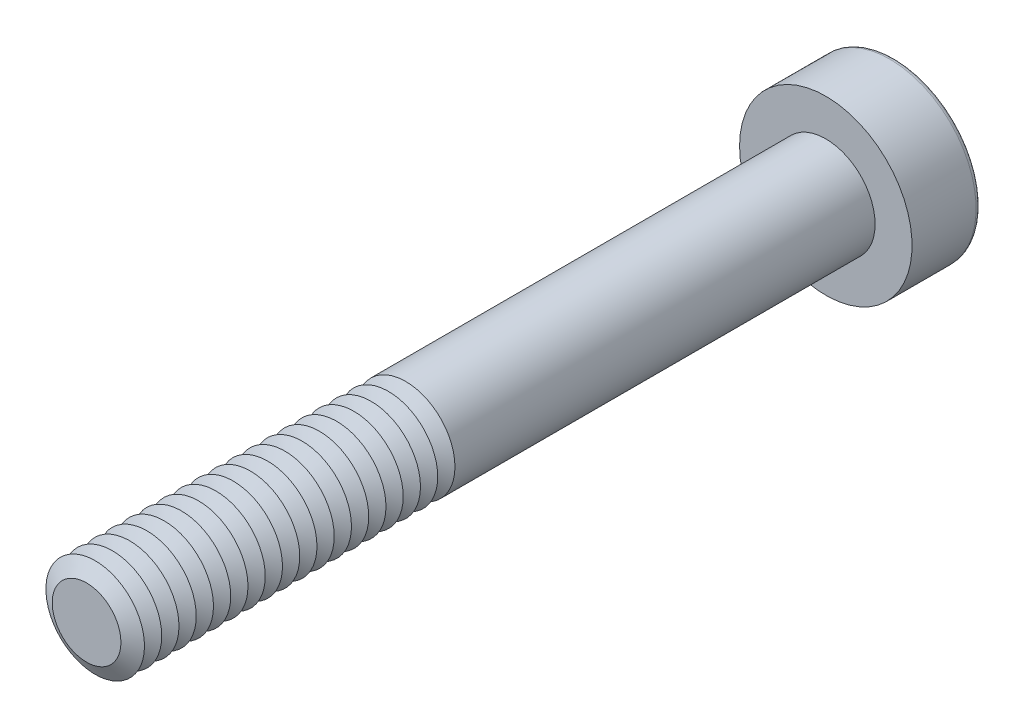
ISO-10303-21;
HEADER;
FILE_DESCRIPTION(('STEP AP214'),'2;1');
FILE_NAME('part.step','',(''),(''),'','','');
FILE_SCHEMA(('AUTOMOTIVE_DESIGN { 1 0 10303 214 1 1 1 1 }'));
ENDSEC;
DATA;
#1=APPLICATION_CONTEXT('core data for automotive mechanical design processes');
#2=APPLICATION_PROTOCOL_DEFINITION('international standard','automotive_design',2000,#1);
#3=PRODUCT_CONTEXT('',#1,'mechanical');
#4=PRODUCT('Part','Part','',(#3));
#5=PRODUCT_RELATED_PRODUCT_CATEGORY('part','',(#4));
#6=PRODUCT_DEFINITION_FORMATION('','',#4);
#7=PRODUCT_DEFINITION_CONTEXT('part definition',#1,'design');
#8=PRODUCT_DEFINITION('design','',#6,#7);
#9=PRODUCT_DEFINITION_SHAPE('','',#8);
#10=(LENGTH_UNIT() NAMED_UNIT(*) SI_UNIT(.MILLI.,.METRE.));
#11=(NAMED_UNIT(*) PLANE_ANGLE_UNIT() SI_UNIT($,.RADIAN.));
#12=(NAMED_UNIT(*) SI_UNIT($,.STERADIAN.) SOLID_ANGLE_UNIT());
#13=UNCERTAINTY_MEASURE_WITH_UNIT(LENGTH_MEASURE(1.E-05),#10,'distance_accuracy_value','');
#14=(GEOMETRIC_REPRESENTATION_CONTEXT(3) GLOBAL_UNCERTAINTY_ASSIGNED_CONTEXT((#13)) GLOBAL_UNIT_ASSIGNED_CONTEXT((#10,
#11,#12)) REPRESENTATION_CONTEXT('',''));
#15=CARTESIAN_POINT('',(0.,0.,0.));
#16=DIRECTION('',(0.,0.,1.));
#17=DIRECTION('',(1.,0.,0.));
#18=AXIS2_PLACEMENT_3D('',#15,#16,#17);
#19=CARTESIAN_POINT('',(0.,0.,27.55));
#20=DIRECTION('',(0.,0.,1.));
#21=DIRECTION('',(1.,0.,0.));
#22=AXIS2_PLACEMENT_3D('',#19,#20,#21);
#23=CONICAL_SURFACE('',#22,2.,1.0471975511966);
#24=CARTESIAN_POINT('',(0.,0.,27.2));
#25=DIRECTION('',(0.,0.,1.));
#26=DIRECTION('',(1.,0.,0.));
#27=AXIS2_PLACEMENT_3D('',#24,#25,#26);
#28=CIRCLE('',#27,1.39378221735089);
#29=CARTESIAN_POINT('',(1.39378221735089,0.,27.2));
#30=VERTEX_POINT('',#29);
#31=EDGE_CURVE('E312',#30,#30,#28,.T.);
#32=ORIENTED_EDGE('',*,*,#31,.T.);
#33=EDGE_LOOP('',(#32));
#34=FACE_BOUND('',#33,.T.);
#35=CARTESIAN_POINT('',(0.,0.,27.55));
#36=DIRECTION('',(0.,0.,1.));
#37=DIRECTION('',(1.,0.,0.));
#38=AXIS2_PLACEMENT_3D('',#35,#36,#37);
#39=CIRCLE('',#38,2.);
#40=CARTESIAN_POINT('',(2.,0.,27.55));
#41=VERTEX_POINT('',#40);
#42=EDGE_CURVE('E315',#41,#41,#39,.T.);
#43=ORIENTED_EDGE('',*,*,#42,.F.);
#44=EDGE_LOOP('',(#43));
#45=FACE_BOUND('',#44,.T.);
#46=ADVANCED_FACE('F39',(#34,#45),#23,.T.);
#47=CARTESIAN_POINT('',(0.,0.,27.2));
#48=DIRECTION('',(0.,0.,-1.));
#49=DIRECTION('',(-1.,0.,0.));
#50=AXIS2_PLACEMENT_3D('',#47,#48,#49);
#51=CONICAL_SURFACE('',#50,1.39378221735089,1.0471975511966);
#52=CARTESIAN_POINT('',(0.,0.,26.85));
#53=DIRECTION('',(0.,0.,1.));
#54=DIRECTION('',(1.,0.,0.));
#55=AXIS2_PLACEMENT_3D('',#52,#53,#54);
#56=CIRCLE('',#55,2.);
#57=CARTESIAN_POINT('',(2.,0.,26.85));
#58=VERTEX_POINT('',#57);
#59=EDGE_CURVE('E323',#58,#58,#56,.T.);
#60=ORIENTED_EDGE('',*,*,#59,.T.);
#61=EDGE_LOOP('',(#60));
#62=FACE_BOUND('',#61,.T.);
#63=ORIENTED_EDGE('',*,*,#31,.F.);
#64=EDGE_LOOP('',(#63));
#65=FACE_BOUND('',#64,.T.);
#66=ADVANCED_FACE('F245',(#62,#65),#51,.T.);
#67=CARTESIAN_POINT('',(0.,0.,30.));
#68=DIRECTION('',(0.,0.,1.));
#69=DIRECTION('',(1.,0.,0.));
#70=AXIS2_PLACEMENT_3D('',#67,#68,#69);
#71=PLANE('',#70);
#72=CARTESIAN_POINT('',(0.,0.,30.));
#73=DIRECTION('',(0.,0.,1.));
#74=DIRECTION('',(1.,0.,0.));
#75=AXIS2_PLACEMENT_3D('',#72,#73,#74);
#76=CIRCLE('',#75,1.39378221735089);
#77=CARTESIAN_POINT('',(1.39378221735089,0.,30.));
#78=VERTEX_POINT('',#77);
#79=EDGE_CURVE('E174',#78,#78,#76,.T.);
#80=ORIENTED_EDGE('',*,*,#79,.T.);
#81=EDGE_LOOP('',(#80));
#82=FACE_BOUND('',#81,.T.);
#83=ADVANCED_FACE('F251',(#82),#71,.T.);
#84=CARTESIAN_POINT('',(0.,0.,30.));
#85=DIRECTION('',(0.,0.,-1.));
#86=DIRECTION('',(-1.,0.,0.));
#87=AXIS2_PLACEMENT_3D('',#84,#85,#86);
#88=CONICAL_SURFACE('',#87,1.39378221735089,1.0471975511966);
#89=CARTESIAN_POINT('',(0.,0.,29.65));
#90=DIRECTION('',(0.,0.,1.));
#91=DIRECTION('',(1.,0.,0.));
#92=AXIS2_PLACEMENT_3D('',#89,#90,#91);
#93=CIRCLE('',#92,2.);
#94=CARTESIAN_POINT('',(2.,0.,29.65));
#95=VERTEX_POINT('',#94);
#96=EDGE_CURVE('E291',#95,#95,#93,.T.);
#97=ORIENTED_EDGE('',*,*,#96,.T.);
#98=EDGE_LOOP('',(#97));
#99=FACE_BOUND('',#98,.T.);
#100=ORIENTED_EDGE('',*,*,#79,.F.);
#101=EDGE_LOOP('',(#100));
#102=FACE_BOUND('',#101,.T.);
#103=ADVANCED_FACE('F199',(#99,#102),#88,.T.);
#104=CARTESIAN_POINT('',(0.,0.,29.65));
#105=DIRECTION('',(0.,0.,1.));
#106=DIRECTION('',(1.,0.,0.));
#107=AXIS2_PLACEMENT_3D('',#104,#105,#106);
#108=CONICAL_SURFACE('',#107,2.,1.0471975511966);
#109=CARTESIAN_POINT('',(0.,0.,29.3));
#110=DIRECTION('',(0.,0.,1.));
#111=DIRECTION('',(1.,0.,0.));
#112=AXIS2_PLACEMENT_3D('',#109,#110,#111);
#113=CIRCLE('',#112,1.39378221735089);
#114=CARTESIAN_POINT('',(1.39378221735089,0.,29.3));
#115=VERTEX_POINT('',#114);
#116=EDGE_CURVE('E288',#115,#115,#113,.T.);
#117=ORIENTED_EDGE('',*,*,#116,.T.);
#118=EDGE_LOOP('',(#117));
#119=FACE_BOUND('',#118,.T.);
#120=ORIENTED_EDGE('',*,*,#96,.F.);
#121=EDGE_LOOP('',(#120));
#122=FACE_BOUND('',#121,.T.);
#123=ADVANCED_FACE('F277',(#119,#122),#108,.T.);
#124=CARTESIAN_POINT('',(0.,0.,29.3));
#125=DIRECTION('',(0.,0.,-1.));
#126=DIRECTION('',(-1.,0.,0.));
#127=AXIS2_PLACEMENT_3D('',#124,#125,#126);
#128=CONICAL_SURFACE('',#127,1.39378221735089,1.0471975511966);
#129=CARTESIAN_POINT('',(0.,0.,28.95));
#130=DIRECTION('',(0.,0.,1.));
#131=DIRECTION('',(1.,0.,0.));
#132=AXIS2_PLACEMENT_3D('',#129,#130,#131);
#133=CIRCLE('',#132,2.);
#134=CARTESIAN_POINT('',(2.,0.,28.95));
#135=VERTEX_POINT('',#134);
#136=EDGE_CURVE('E298',#135,#135,#133,.T.);
#137=ORIENTED_EDGE('',*,*,#136,.T.);
#138=EDGE_LOOP('',(#137));
#139=FACE_BOUND('',#138,.T.);
#140=ORIENTED_EDGE('',*,*,#116,.F.);
#141=EDGE_LOOP('',(#140));
#142=FACE_BOUND('',#141,.T.);
#143=ADVANCED_FACE('F274',(#139,#142),#128,.T.);
#144=CARTESIAN_POINT('',(0.,0.,28.95));
#145=DIRECTION('',(0.,0.,1.));
#146=DIRECTION('',(1.,0.,0.));
#147=AXIS2_PLACEMENT_3D('',#144,#145,#146);
#148=CONICAL_SURFACE('',#147,2.,1.0471975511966);
#149=CARTESIAN_POINT('',(0.,0.,28.6));
#150=DIRECTION('',(0.,0.,1.));
#151=DIRECTION('',(1.,0.,0.));
#152=AXIS2_PLACEMENT_3D('',#149,#150,#151);
#153=CIRCLE('',#152,1.39378221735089);
#154=CARTESIAN_POINT('',(1.39378221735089,0.,28.6));
#155=VERTEX_POINT('',#154);
#156=EDGE_CURVE('E292',#155,#155,#153,.T.);
#157=ORIENTED_EDGE('',*,*,#156,.T.);
#158=EDGE_LOOP('',(#157));
#159=FACE_BOUND('',#158,.T.);
#160=ORIENTED_EDGE('',*,*,#136,.F.);
#161=EDGE_LOOP('',(#160));
#162=FACE_BOUND('',#161,.T.);
#163=ADVANCED_FACE('F270',(#159,#162),#148,.T.);
#164=CARTESIAN_POINT('',(0.,0.,28.6));
#165=DIRECTION('',(0.,0.,-1.));
#166=DIRECTION('',(-1.,0.,0.));
#167=AXIS2_PLACEMENT_3D('',#164,#165,#166);
#168=CONICAL_SURFACE('',#167,1.39378221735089,1.0471975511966);
#169=CARTESIAN_POINT('',(0.,0.,28.25));
#170=DIRECTION('',(0.,0.,1.));
#171=DIRECTION('',(1.,0.,0.));
#172=AXIS2_PLACEMENT_3D('',#169,#170,#171);
#173=CIRCLE('',#172,2.);
#174=CARTESIAN_POINT('',(2.,0.,28.25));
#175=VERTEX_POINT('',#174);
#176=EDGE_CURVE('E308',#175,#175,#173,.T.);
#177=ORIENTED_EDGE('',*,*,#176,.T.);
#178=EDGE_LOOP('',(#177));
#179=FACE_BOUND('',#178,.T.);
#180=ORIENTED_EDGE('',*,*,#156,.F.);
#181=EDGE_LOOP('',(#180));
#182=FACE_BOUND('',#181,.T.);
#183=ADVANCED_FACE('F266',(#179,#182),#168,.T.);
#184=CARTESIAN_POINT('',(0.,0.,28.25));
#185=DIRECTION('',(0.,0.,1.));
#186=DIRECTION('',(1.,0.,0.));
#187=AXIS2_PLACEMENT_3D('',#184,#185,#186);
#188=CONICAL_SURFACE('',#187,2.,1.0471975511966);
#189=CARTESIAN_POINT('',(0.,0.,27.9));
#190=DIRECTION('',(0.,0.,1.));
#191=DIRECTION('',(1.,0.,0.));
#192=AXIS2_PLACEMENT_3D('',#189,#190,#191);
#193=CIRCLE('',#192,1.39378221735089);
#194=CARTESIAN_POINT('',(1.39378221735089,0.,27.9));
#195=VERTEX_POINT('',#194);
#196=EDGE_CURVE('E304',#195,#195,#193,.T.);
#197=ORIENTED_EDGE('',*,*,#196,.T.);
#198=EDGE_LOOP('',(#197));
#199=FACE_BOUND('',#198,.T.);
#200=ORIENTED_EDGE('',*,*,#176,.F.);
#201=EDGE_LOOP('',(#200));
#202=FACE_BOUND('',#201,.T.);
#203=ADVANCED_FACE('F262',(#199,#202),#188,.T.);
#204=CARTESIAN_POINT('',(0.,0.,27.9));
#205=DIRECTION('',(0.,0.,-1.));
#206=DIRECTION('',(-1.,0.,0.));
#207=AXIS2_PLACEMENT_3D('',#204,#205,#206);
#208=CONICAL_SURFACE('',#207,1.39378221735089,1.0471975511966);
#209=ORIENTED_EDGE('',*,*,#42,.T.);
#210=EDGE_LOOP('',(#209));
#211=FACE_BOUND('',#210,.T.);
#212=ORIENTED_EDGE('',*,*,#196,.F.);
#213=EDGE_LOOP('',(#212));
#214=FACE_BOUND('',#213,.T.);
#215=ADVANCED_FACE('F258',(#211,#214),#208,.T.);
#216=CARTESIAN_POINT('',(0.,0.,26.85));
#217=DIRECTION('',(0.,0.,1.));
#218=DIRECTION('',(1.,0.,0.));
#219=AXIS2_PLACEMENT_3D('',#216,#217,#218);
#220=CONICAL_SURFACE('',#219,2.,1.0471975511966);
#221=CARTESIAN_POINT('',(0.,0.,26.5));
#222=DIRECTION('',(0.,0.,1.));
#223=DIRECTION('',(1.,0.,0.));
#224=AXIS2_PLACEMENT_3D('',#221,#222,#223);
#225=CIRCLE('',#224,1.39378221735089);
#226=CARTESIAN_POINT('',(1.39378221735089,0.,26.5));
#227=VERTEX_POINT('',#226);
#228=EDGE_CURVE('E319',#227,#227,#225,.T.);
#229=ORIENTED_EDGE('',*,*,#228,.T.);
#230=EDGE_LOOP('',(#229));
#231=FACE_BOUND('',#230,.T.);
#232=ORIENTED_EDGE('',*,*,#59,.F.);
#233=EDGE_LOOP('',(#232));
#234=FACE_BOUND('',#233,.T.);
#235=ADVANCED_FACE('F261',(#231,#234),#220,.T.);
#236=CARTESIAN_POINT('',(0.,0.,26.5));
#237=DIRECTION('',(0.,0.,-1.));
#238=DIRECTION('',(-1.,0.,0.));
#239=AXIS2_PLACEMENT_3D('',#236,#237,#238);
#240=CONICAL_SURFACE('',#239,1.39378221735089,1.0471975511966);
#241=CARTESIAN_POINT('',(0.,0.,26.15));
#242=DIRECTION('',(0.,0.,1.));
#243=DIRECTION('',(1.,0.,0.));
#244=AXIS2_PLACEMENT_3D('',#241,#242,#243);
#245=CIRCLE('',#244,2.);
#246=CARTESIAN_POINT('',(2.,0.,26.15));
#247=VERTEX_POINT('',#246);
#248=EDGE_CURVE('E331',#247,#247,#245,.T.);
#249=ORIENTED_EDGE('',*,*,#248,.T.);
#250=EDGE_LOOP('',(#249));
#251=FACE_BOUND('',#250,.T.);
#252=ORIENTED_EDGE('',*,*,#228,.F.);
#253=EDGE_LOOP('',(#252));
#254=FACE_BOUND('',#253,.T.);
#255=ADVANCED_FACE('F542',(#251,#254),#240,.T.);
#256=CARTESIAN_POINT('',(0.,0.,26.15));
#257=DIRECTION('',(0.,0.,1.));
#258=DIRECTION('',(1.,0.,0.));
#259=AXIS2_PLACEMENT_3D('',#256,#257,#258);
#260=CONICAL_SURFACE('',#259,2.,1.0471975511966);
#261=CARTESIAN_POINT('',(0.,0.,25.8));
#262=DIRECTION('',(0.,0.,1.));
#263=DIRECTION('',(1.,0.,0.));
#264=AXIS2_PLACEMENT_3D('',#261,#262,#263);
#265=CIRCLE('',#264,1.39378221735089);
#266=CARTESIAN_POINT('',(1.39378221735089,0.,25.8));
#267=VERTEX_POINT('',#266);
#268=EDGE_CURVE('E327',#267,#267,#265,.T.);
#269=ORIENTED_EDGE('',*,*,#268,.T.);
#270=EDGE_LOOP('',(#269));
#271=FACE_BOUND('',#270,.T.);
#272=ORIENTED_EDGE('',*,*,#248,.F.);
#273=EDGE_LOOP('',(#272));
#274=FACE_BOUND('',#273,.T.);
#275=ADVANCED_FACE('F538',(#271,#274),#260,.T.);
#276=CARTESIAN_POINT('',(0.,0.,25.8));
#277=DIRECTION('',(0.,0.,-1.));
#278=DIRECTION('',(-1.,0.,0.));
#279=AXIS2_PLACEMENT_3D('',#276,#277,#278);
#280=CONICAL_SURFACE('',#279,1.39378221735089,1.0471975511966);
#281=CARTESIAN_POINT('',(0.,0.,25.45));
#282=DIRECTION('',(0.,0.,1.));
#283=DIRECTION('',(1.,0.,0.));
#284=AXIS2_PLACEMENT_3D('',#281,#282,#283);
#285=CIRCLE('',#284,2.);
#286=CARTESIAN_POINT('',(2.,0.,25.45));
#287=VERTEX_POINT('',#286);
#288=EDGE_CURVE('E339',#287,#287,#285,.T.);
#289=ORIENTED_EDGE('',*,*,#288,.T.);
#290=EDGE_LOOP('',(#289));
#291=FACE_BOUND('',#290,.T.);
#292=ORIENTED_EDGE('',*,*,#268,.F.);
#293=EDGE_LOOP('',(#292));
#294=FACE_BOUND('',#293,.T.);
#295=ADVANCED_FACE('F534',(#291,#294),#280,.T.);
#296=CARTESIAN_POINT('',(0.,0.,25.45));
#297=DIRECTION('',(0.,0.,1.));
#298=DIRECTION('',(1.,0.,0.));
#299=AXIS2_PLACEMENT_3D('',#296,#297,#298);
#300=CONICAL_SURFACE('',#299,2.,1.0471975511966);
#301=CARTESIAN_POINT('',(0.,0.,25.1));
#302=DIRECTION('',(0.,0.,1.));
#303=DIRECTION('',(1.,0.,0.));
#304=AXIS2_PLACEMENT_3D('',#301,#302,#303);
#305=CIRCLE('',#304,1.39378221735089);
#306=CARTESIAN_POINT('',(1.39378221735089,0.,25.1));
#307=VERTEX_POINT('',#306);
#308=EDGE_CURVE('E335',#307,#307,#305,.T.);
#309=ORIENTED_EDGE('',*,*,#308,.T.);
#310=EDGE_LOOP('',(#309));
#311=FACE_BOUND('',#310,.T.);
#312=ORIENTED_EDGE('',*,*,#288,.F.);
#313=EDGE_LOOP('',(#312));
#314=FACE_BOUND('',#313,.T.);
#315=ADVANCED_FACE('F530',(#311,#314),#300,.T.);
#316=CARTESIAN_POINT('',(0.,0.,25.1));
#317=DIRECTION('',(0.,0.,-1.));
#318=DIRECTION('',(-1.,0.,0.));
#319=AXIS2_PLACEMENT_3D('',#316,#317,#318);
#320=CONICAL_SURFACE('',#319,1.39378221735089,1.0471975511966);
#321=CARTESIAN_POINT('',(0.,0.,24.75));
#322=DIRECTION('',(0.,0.,1.));
#323=DIRECTION('',(1.,0.,0.));
#324=AXIS2_PLACEMENT_3D('',#321,#322,#323);
#325=CIRCLE('',#324,2.);
#326=CARTESIAN_POINT('',(2.,0.,24.75));
#327=VERTEX_POINT('',#326);
#328=EDGE_CURVE('E347',#327,#327,#325,.T.);
#329=ORIENTED_EDGE('',*,*,#328,.T.);
#330=EDGE_LOOP('',(#329));
#331=FACE_BOUND('',#330,.T.);
#332=ORIENTED_EDGE('',*,*,#308,.F.);
#333=EDGE_LOOP('',(#332));
#334=FACE_BOUND('',#333,.T.);
#335=ADVANCED_FACE('F526',(#331,#334),#320,.T.);
#336=CARTESIAN_POINT('',(0.,0.,24.75));
#337=DIRECTION('',(0.,0.,1.));
#338=DIRECTION('',(1.,0.,0.));
#339=AXIS2_PLACEMENT_3D('',#336,#337,#338);
#340=CONICAL_SURFACE('',#339,2.,1.0471975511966);
#341=CARTESIAN_POINT('',(0.,0.,24.4));
#342=DIRECTION('',(0.,0.,1.));
#343=DIRECTION('',(1.,0.,0.));
#344=AXIS2_PLACEMENT_3D('',#341,#342,#343);
#345=CIRCLE('',#344,1.39378221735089);
#346=CARTESIAN_POINT('',(1.39378221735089,0.,24.4));
#347=VERTEX_POINT('',#346);
#348=EDGE_CURVE('E343',#347,#347,#345,.T.);
#349=ORIENTED_EDGE('',*,*,#348,.T.);
#350=EDGE_LOOP('',(#349));
#351=FACE_BOUND('',#350,.T.);
#352=ORIENTED_EDGE('',*,*,#328,.F.);
#353=EDGE_LOOP('',(#352));
#354=FACE_BOUND('',#353,.T.);
#355=ADVANCED_FACE('F522',(#351,#354),#340,.T.);
#356=CARTESIAN_POINT('',(0.,0.,24.4));
#357=DIRECTION('',(0.,0.,-1.));
#358=DIRECTION('',(-1.,0.,0.));
#359=AXIS2_PLACEMENT_3D('',#356,#357,#358);
#360=CONICAL_SURFACE('',#359,1.39378221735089,1.0471975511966);
#361=CARTESIAN_POINT('',(0.,0.,24.05));
#362=DIRECTION('',(0.,0.,1.));
#363=DIRECTION('',(1.,0.,0.));
#364=AXIS2_PLACEMENT_3D('',#361,#362,#363);
#365=CIRCLE('',#364,2.);
#366=CARTESIAN_POINT('',(2.,0.,24.05));
#367=VERTEX_POINT('',#366);
#368=EDGE_CURVE('E355',#367,#367,#365,.T.);
#369=ORIENTED_EDGE('',*,*,#368,.T.);
#370=EDGE_LOOP('',(#369));
#371=FACE_BOUND('',#370,.T.);
#372=ORIENTED_EDGE('',*,*,#348,.F.);
#373=EDGE_LOOP('',(#372));
#374=FACE_BOUND('',#373,.T.);
#375=ADVANCED_FACE('F518',(#371,#374),#360,.T.);
#376=CARTESIAN_POINT('',(0.,0.,24.05));
#377=DIRECTION('',(0.,0.,1.));
#378=DIRECTION('',(1.,0.,0.));
#379=AXIS2_PLACEMENT_3D('',#376,#377,#378);
#380=CONICAL_SURFACE('',#379,2.,1.0471975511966);
#381=CARTESIAN_POINT('',(0.,0.,23.7));
#382=DIRECTION('',(0.,0.,1.));
#383=DIRECTION('',(1.,0.,0.));
#384=AXIS2_PLACEMENT_3D('',#381,#382,#383);
#385=CIRCLE('',#384,1.39378221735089);
#386=CARTESIAN_POINT('',(1.39378221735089,0.,23.7));
#387=VERTEX_POINT('',#386);
#388=EDGE_CURVE('E351',#387,#387,#385,.T.);
#389=ORIENTED_EDGE('',*,*,#388,.T.);
#390=EDGE_LOOP('',(#389));
#391=FACE_BOUND('',#390,.T.);
#392=ORIENTED_EDGE('',*,*,#368,.F.);
#393=EDGE_LOOP('',(#392));
#394=FACE_BOUND('',#393,.T.);
#395=ADVANCED_FACE('F514',(#391,#394),#380,.T.);
#396=CARTESIAN_POINT('',(0.,0.,23.7));
#397=DIRECTION('',(0.,0.,-1.));
#398=DIRECTION('',(-1.,0.,0.));
#399=AXIS2_PLACEMENT_3D('',#396,#397,#398);
#400=CONICAL_SURFACE('',#399,1.39378221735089,1.0471975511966);
#401=CARTESIAN_POINT('',(0.,0.,23.35));
#402=DIRECTION('',(0.,0.,1.));
#403=DIRECTION('',(1.,0.,0.));
#404=AXIS2_PLACEMENT_3D('',#401,#402,#403);
#405=CIRCLE('',#404,2.);
#406=CARTESIAN_POINT('',(2.,0.,23.35));
#407=VERTEX_POINT('',#406);
#408=EDGE_CURVE('E363',#407,#407,#405,.T.);
#409=ORIENTED_EDGE('',*,*,#408,.T.);
#410=EDGE_LOOP('',(#409));
#411=FACE_BOUND('',#410,.T.);
#412=ORIENTED_EDGE('',*,*,#388,.F.);
#413=EDGE_LOOP('',(#412));
#414=FACE_BOUND('',#413,.T.);
#415=ADVANCED_FACE('F510',(#411,#414),#400,.T.);
#416=CARTESIAN_POINT('',(0.,0.,23.35));
#417=DIRECTION('',(0.,0.,1.));
#418=DIRECTION('',(1.,0.,0.));
#419=AXIS2_PLACEMENT_3D('',#416,#417,#418);
#420=CONICAL_SURFACE('',#419,2.,1.0471975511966);
#421=CARTESIAN_POINT('',(0.,0.,23.));
#422=DIRECTION('',(0.,0.,1.));
#423=DIRECTION('',(1.,0.,0.));
#424=AXIS2_PLACEMENT_3D('',#421,#422,#423);
#425=CIRCLE('',#424,1.39378221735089);
#426=CARTESIAN_POINT('',(1.39378221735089,0.,23.));
#427=VERTEX_POINT('',#426);
#428=EDGE_CURVE('E359',#427,#427,#425,.T.);
#429=ORIENTED_EDGE('',*,*,#428,.T.);
#430=EDGE_LOOP('',(#429));
#431=FACE_BOUND('',#430,.T.);
#432=ORIENTED_EDGE('',*,*,#408,.F.);
#433=EDGE_LOOP('',(#432));
#434=FACE_BOUND('',#433,.T.);
#435=ADVANCED_FACE('F506',(#431,#434),#420,.T.);
#436=CARTESIAN_POINT('',(0.,0.,23.));
#437=DIRECTION('',(0.,0.,-1.));
#438=DIRECTION('',(-1.,0.,0.));
#439=AXIS2_PLACEMENT_3D('',#436,#437,#438);
#440=CONICAL_SURFACE('',#439,1.39378221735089,1.0471975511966);
#441=CARTESIAN_POINT('',(0.,0.,22.65));
#442=DIRECTION('',(0.,0.,1.));
#443=DIRECTION('',(1.,0.,0.));
#444=AXIS2_PLACEMENT_3D('',#441,#442,#443);
#445=CIRCLE('',#444,2.);
#446=CARTESIAN_POINT('',(2.,0.,22.65));
#447=VERTEX_POINT('',#446);
#448=EDGE_CURVE('E371',#447,#447,#445,.T.);
#449=ORIENTED_EDGE('',*,*,#448,.T.);
#450=EDGE_LOOP('',(#449));
#451=FACE_BOUND('',#450,.T.);
#452=ORIENTED_EDGE('',*,*,#428,.F.);
#453=EDGE_LOOP('',(#452));
#454=FACE_BOUND('',#453,.T.);
#455=ADVANCED_FACE('F502',(#451,#454),#440,.T.);
#456=CARTESIAN_POINT('',(0.,0.,22.65));
#457=DIRECTION('',(0.,0.,1.));
#458=DIRECTION('',(1.,0.,0.));
#459=AXIS2_PLACEMENT_3D('',#456,#457,#458);
#460=CONICAL_SURFACE('',#459,2.,1.0471975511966);
#461=CARTESIAN_POINT('',(0.,0.,22.3));
#462=DIRECTION('',(0.,0.,1.));
#463=DIRECTION('',(1.,0.,0.));
#464=AXIS2_PLACEMENT_3D('',#461,#462,#463);
#465=CIRCLE('',#464,1.39378221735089);
#466=CARTESIAN_POINT('',(1.39378221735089,0.,22.3));
#467=VERTEX_POINT('',#466);
#468=EDGE_CURVE('E367',#467,#467,#465,.T.);
#469=ORIENTED_EDGE('',*,*,#468,.T.);
#470=EDGE_LOOP('',(#469));
#471=FACE_BOUND('',#470,.T.);
#472=ORIENTED_EDGE('',*,*,#448,.F.);
#473=EDGE_LOOP('',(#472));
#474=FACE_BOUND('',#473,.T.);
#475=ADVANCED_FACE('F498',(#471,#474),#460,.T.);
#476=CARTESIAN_POINT('',(0.,0.,22.3));
#477=DIRECTION('',(0.,0.,-1.));
#478=DIRECTION('',(-1.,0.,0.));
#479=AXIS2_PLACEMENT_3D('',#476,#477,#478);
#480=CONICAL_SURFACE('',#479,1.39378221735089,1.0471975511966);
#481=CARTESIAN_POINT('',(0.,0.,21.95));
#482=DIRECTION('',(0.,0.,1.));
#483=DIRECTION('',(1.,0.,0.));
#484=AXIS2_PLACEMENT_3D('',#481,#482,#483);
#485=CIRCLE('',#484,2.);
#486=CARTESIAN_POINT('',(2.,0.,21.95));
#487=VERTEX_POINT('',#486);
#488=EDGE_CURVE('E379',#487,#487,#485,.T.);
#489=ORIENTED_EDGE('',*,*,#488,.T.);
#490=EDGE_LOOP('',(#489));
#491=FACE_BOUND('',#490,.T.);
#492=ORIENTED_EDGE('',*,*,#468,.F.);
#493=EDGE_LOOP('',(#492));
#494=FACE_BOUND('',#493,.T.);
#495=ADVANCED_FACE('F494',(#491,#494),#480,.T.);
#496=CARTESIAN_POINT('',(0.,0.,21.95));
#497=DIRECTION('',(0.,0.,1.));
#498=DIRECTION('',(1.,0.,0.));
#499=AXIS2_PLACEMENT_3D('',#496,#497,#498);
#500=CONICAL_SURFACE('',#499,2.,1.0471975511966);
#501=CARTESIAN_POINT('',(0.,0.,21.6));
#502=DIRECTION('',(0.,0.,1.));
#503=DIRECTION('',(1.,0.,0.));
#504=AXIS2_PLACEMENT_3D('',#501,#502,#503);
#505=CIRCLE('',#504,1.39378221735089);
#506=CARTESIAN_POINT('',(1.39378221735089,0.,21.6));
#507=VERTEX_POINT('',#506);
#508=EDGE_CURVE('E375',#507,#507,#505,.T.);
#509=ORIENTED_EDGE('',*,*,#508,.T.);
#510=EDGE_LOOP('',(#509));
#511=FACE_BOUND('',#510,.T.);
#512=ORIENTED_EDGE('',*,*,#488,.F.);
#513=EDGE_LOOP('',(#512));
#514=FACE_BOUND('',#513,.T.);
#515=ADVANCED_FACE('F490',(#511,#514),#500,.T.);
#516=CARTESIAN_POINT('',(0.,0.,21.6));
#517=DIRECTION('',(0.,0.,-1.));
#518=DIRECTION('',(-1.,0.,0.));
#519=AXIS2_PLACEMENT_3D('',#516,#517,#518);
#520=CONICAL_SURFACE('',#519,1.39378221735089,1.0471975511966);
#521=CARTESIAN_POINT('',(0.,0.,21.25));
#522=DIRECTION('',(0.,0.,1.));
#523=DIRECTION('',(1.,0.,0.));
#524=AXIS2_PLACEMENT_3D('',#521,#522,#523);
#525=CIRCLE('',#524,2.);
#526=CARTESIAN_POINT('',(2.,0.,21.25));
#527=VERTEX_POINT('',#526);
#528=EDGE_CURVE('E387',#527,#527,#525,.T.);
#529=ORIENTED_EDGE('',*,*,#528,.T.);
#530=EDGE_LOOP('',(#529));
#531=FACE_BOUND('',#530,.T.);
#532=ORIENTED_EDGE('',*,*,#508,.F.);
#533=EDGE_LOOP('',(#532));
#534=FACE_BOUND('',#533,.T.);
#535=ADVANCED_FACE('F486',(#531,#534),#520,.T.);
#536=CARTESIAN_POINT('',(0.,0.,21.25));
#537=DIRECTION('',(0.,0.,1.));
#538=DIRECTION('',(1.,0.,0.));
#539=AXIS2_PLACEMENT_3D('',#536,#537,#538);
#540=CONICAL_SURFACE('',#539,2.,1.0471975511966);
#541=CARTESIAN_POINT('',(0.,0.,20.9));
#542=DIRECTION('',(0.,0.,1.));
#543=DIRECTION('',(1.,0.,0.));
#544=AXIS2_PLACEMENT_3D('',#541,#542,#543);
#545=CIRCLE('',#544,1.39378221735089);
#546=CARTESIAN_POINT('',(1.39378221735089,0.,20.9));
#547=VERTEX_POINT('',#546);
#548=EDGE_CURVE('E383',#547,#547,#545,.T.);
#549=ORIENTED_EDGE('',*,*,#548,.T.);
#550=EDGE_LOOP('',(#549));
#551=FACE_BOUND('',#550,.T.);
#552=ORIENTED_EDGE('',*,*,#528,.F.);
#553=EDGE_LOOP('',(#552));
#554=FACE_BOUND('',#553,.T.);
#555=ADVANCED_FACE('F482',(#551,#554),#540,.T.);
#556=CARTESIAN_POINT('',(0.,0.,20.9));
#557=DIRECTION('',(0.,0.,-1.));
#558=DIRECTION('',(-1.,0.,0.));
#559=AXIS2_PLACEMENT_3D('',#556,#557,#558);
#560=CONICAL_SURFACE('',#559,1.39378221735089,1.0471975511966);
#561=CARTESIAN_POINT('',(0.,0.,20.55));
#562=DIRECTION('',(0.,0.,1.));
#563=DIRECTION('',(1.,0.,0.));
#564=AXIS2_PLACEMENT_3D('',#561,#562,#563);
#565=CIRCLE('',#564,2.);
#566=CARTESIAN_POINT('',(2.,0.,20.55));
#567=VERTEX_POINT('',#566);
#568=EDGE_CURVE('E394',#567,#567,#565,.T.);
#569=ORIENTED_EDGE('',*,*,#568,.T.);
#570=EDGE_LOOP('',(#569));
#571=FACE_BOUND('',#570,.T.);
#572=ORIENTED_EDGE('',*,*,#548,.F.);
#573=EDGE_LOOP('',(#572));
#574=FACE_BOUND('',#573,.T.);
#575=ADVANCED_FACE('F478',(#571,#574),#560,.T.);
#576=CARTESIAN_POINT('',(0.,0.,20.55));
#577=DIRECTION('',(0.,0.,1.));
#578=DIRECTION('',(1.,0.,0.));
#579=AXIS2_PLACEMENT_3D('',#576,#577,#578);
#580=CONICAL_SURFACE('',#579,2.,1.0471975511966);
#581=CARTESIAN_POINT('',(0.,0.,20.2));
#582=DIRECTION('',(0.,0.,1.));
#583=DIRECTION('',(1.,0.,0.));
#584=AXIS2_PLACEMENT_3D('',#581,#582,#583);
#585=CIRCLE('',#584,1.39378221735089);
#586=CARTESIAN_POINT('',(1.39378221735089,0.,20.2));
#587=VERTEX_POINT('',#586);
#588=EDGE_CURVE('E391',#587,#587,#585,.T.);
#589=ORIENTED_EDGE('',*,*,#588,.T.);
#590=EDGE_LOOP('',(#589));
#591=FACE_BOUND('',#590,.T.);
#592=ORIENTED_EDGE('',*,*,#568,.F.);
#593=EDGE_LOOP('',(#592));
#594=FACE_BOUND('',#593,.T.);
#595=ADVANCED_FACE('F474',(#591,#594),#580,.T.);
#596=CARTESIAN_POINT('',(0.,0.,20.2));
#597=DIRECTION('',(0.,0.,-1.));
#598=DIRECTION('',(-1.,0.,0.));
#599=AXIS2_PLACEMENT_3D('',#596,#597,#598);
#600=CONICAL_SURFACE('',#599,1.39378221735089,1.0471975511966);
#601=CARTESIAN_POINT('',(0.,0.,19.85));
#602=DIRECTION('',(0.,0.,1.));
#603=DIRECTION('',(1.,0.,0.));
#604=AXIS2_PLACEMENT_3D('',#601,#602,#603);
#605=CIRCLE('',#604,2.);
#606=CARTESIAN_POINT('',(2.,0.,19.85));
#607=VERTEX_POINT('',#606);
#608=EDGE_CURVE('E402',#607,#607,#605,.T.);
#609=ORIENTED_EDGE('',*,*,#608,.T.);
#610=EDGE_LOOP('',(#609));
#611=FACE_BOUND('',#610,.T.);
#612=ORIENTED_EDGE('',*,*,#588,.F.);
#613=EDGE_LOOP('',(#612));
#614=FACE_BOUND('',#613,.T.);
#615=ADVANCED_FACE('F470',(#611,#614),#600,.T.);
#616=CARTESIAN_POINT('',(0.,0.,19.85));
#617=DIRECTION('',(0.,0.,1.));
#618=DIRECTION('',(1.,0.,0.));
#619=AXIS2_PLACEMENT_3D('',#616,#617,#618);
#620=CONICAL_SURFACE('',#619,2.,1.0471975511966);
#621=CARTESIAN_POINT('',(0.,0.,19.5));
#622=DIRECTION('',(0.,0.,1.));
#623=DIRECTION('',(1.,0.,0.));
#624=AXIS2_PLACEMENT_3D('',#621,#622,#623);
#625=CIRCLE('',#624,1.39378221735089);
#626=CARTESIAN_POINT('',(1.39378221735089,0.,19.5));
#627=VERTEX_POINT('',#626);
#628=EDGE_CURVE('E398',#627,#627,#625,.T.);
#629=ORIENTED_EDGE('',*,*,#628,.T.);
#630=EDGE_LOOP('',(#629));
#631=FACE_BOUND('',#630,.T.);
#632=ORIENTED_EDGE('',*,*,#608,.F.);
#633=EDGE_LOOP('',(#632));
#634=FACE_BOUND('',#633,.T.);
#635=ADVANCED_FACE('F466',(#631,#634),#620,.T.);
#636=CARTESIAN_POINT('',(0.,0.,19.5));
#637=DIRECTION('',(0.,0.,-1.));
#638=DIRECTION('',(-1.,0.,0.));
#639=AXIS2_PLACEMENT_3D('',#636,#637,#638);
#640=CONICAL_SURFACE('',#639,1.39378221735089,1.0471975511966);
#641=CARTESIAN_POINT('',(0.,0.,19.15));
#642=DIRECTION('',(0.,0.,1.));
#643=DIRECTION('',(1.,0.,0.));
#644=AXIS2_PLACEMENT_3D('',#641,#642,#643);
#645=CIRCLE('',#644,2.);
#646=CARTESIAN_POINT('',(2.,0.,19.15));
#647=VERTEX_POINT('',#646);
#648=EDGE_CURVE('E410',#647,#647,#645,.T.);
#649=ORIENTED_EDGE('',*,*,#648,.T.);
#650=EDGE_LOOP('',(#649));
#651=FACE_BOUND('',#650,.T.);
#652=ORIENTED_EDGE('',*,*,#628,.F.);
#653=EDGE_LOOP('',(#652));
#654=FACE_BOUND('',#653,.T.);
#655=ADVANCED_FACE('F462',(#651,#654),#640,.T.);
#656=CARTESIAN_POINT('',(0.,0.,19.15));
#657=DIRECTION('',(0.,0.,1.));
#658=DIRECTION('',(1.,0.,0.));
#659=AXIS2_PLACEMENT_3D('',#656,#657,#658);
#660=CONICAL_SURFACE('',#659,2.,1.0471975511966);
#661=CARTESIAN_POINT('',(0.,0.,18.8));
#662=DIRECTION('',(0.,0.,1.));
#663=DIRECTION('',(1.,0.,0.));
#664=AXIS2_PLACEMENT_3D('',#661,#662,#663);
#665=CIRCLE('',#664,1.39378221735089);
#666=CARTESIAN_POINT('',(1.39378221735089,0.,18.8));
#667=VERTEX_POINT('',#666);
#668=EDGE_CURVE('E406',#667,#667,#665,.T.);
#669=ORIENTED_EDGE('',*,*,#668,.T.);
#670=EDGE_LOOP('',(#669));
#671=FACE_BOUND('',#670,.T.);
#672=ORIENTED_EDGE('',*,*,#648,.F.);
#673=EDGE_LOOP('',(#672));
#674=FACE_BOUND('',#673,.T.);
#675=ADVANCED_FACE('F458',(#671,#674),#660,.T.);
#676=CARTESIAN_POINT('',(0.,0.,18.8));
#677=DIRECTION('',(0.,0.,-1.));
#678=DIRECTION('',(-1.,0.,0.));
#679=AXIS2_PLACEMENT_3D('',#676,#677,#678);
#680=CONICAL_SURFACE('',#679,1.39378221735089,1.0471975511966);
#681=CARTESIAN_POINT('',(0.,0.,18.45));
#682=DIRECTION('',(0.,0.,1.));
#683=DIRECTION('',(1.,0.,0.));
#684=AXIS2_PLACEMENT_3D('',#681,#682,#683);
#685=CIRCLE('',#684,2.);
#686=CARTESIAN_POINT('',(2.,0.,18.45));
#687=VERTEX_POINT('',#686);
#688=EDGE_CURVE('E418',#687,#687,#685,.T.);
#689=ORIENTED_EDGE('',*,*,#688,.T.);
#690=EDGE_LOOP('',(#689));
#691=FACE_BOUND('',#690,.T.);
#692=ORIENTED_EDGE('',*,*,#668,.F.);
#693=EDGE_LOOP('',(#692));
#694=FACE_BOUND('',#693,.T.);
#695=ADVANCED_FACE('F454',(#691,#694),#680,.T.);
#696=CARTESIAN_POINT('',(0.,0.,18.45));
#697=DIRECTION('',(0.,0.,1.));
#698=DIRECTION('',(1.,0.,0.));
#699=AXIS2_PLACEMENT_3D('',#696,#697,#698);
#700=CONICAL_SURFACE('',#699,2.,1.0471975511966);
#701=CARTESIAN_POINT('',(0.,0.,18.1));
#702=DIRECTION('',(0.,0.,1.));
#703=DIRECTION('',(1.,0.,0.));
#704=AXIS2_PLACEMENT_3D('',#701,#702,#703);
#705=CIRCLE('',#704,1.39378221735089);
#706=CARTESIAN_POINT('',(1.39378221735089,0.,18.1));
#707=VERTEX_POINT('',#706);
#708=EDGE_CURVE('E414',#707,#707,#705,.T.);
#709=ORIENTED_EDGE('',*,*,#708,.T.);
#710=EDGE_LOOP('',(#709));
#711=FACE_BOUND('',#710,.T.);
#712=ORIENTED_EDGE('',*,*,#688,.F.);
#713=EDGE_LOOP('',(#712));
#714=FACE_BOUND('',#713,.T.);
#715=ADVANCED_FACE('F449',(#711,#714),#700,.T.);
#716=CARTESIAN_POINT('',(0.,0.,18.1));
#717=DIRECTION('',(0.,0.,-1.));
#718=DIRECTION('',(-1.,0.,0.));
#719=AXIS2_PLACEMENT_3D('',#716,#717,#718);
#720=CONICAL_SURFACE('',#719,1.39378221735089,1.0471975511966);
#721=CARTESIAN_POINT('',(0.,0.,17.75));
#722=DIRECTION('',(0.,0.,1.));
#723=DIRECTION('',(1.,0.,0.));
#724=AXIS2_PLACEMENT_3D('',#721,#722,#723);
#725=CIRCLE('',#724,2.);
#726=CARTESIAN_POINT('',(2.,0.,17.75));
#727=VERTEX_POINT('',#726);
#728=EDGE_CURVE('E430',#727,#727,#725,.T.);
#729=ORIENTED_EDGE('',*,*,#728,.T.);
#730=EDGE_LOOP('',(#729));
#731=FACE_BOUND('',#730,.T.);
#732=ORIENTED_EDGE('',*,*,#708,.F.);
#733=EDGE_LOOP('',(#732));
#734=FACE_BOUND('',#733,.T.);
#735=ADVANCED_FACE('F435',(#731,#734),#720,.T.);
#736=CARTESIAN_POINT('',(0.,0.,17.75));
#737=DIRECTION('',(0.,0.,1.));
#738=DIRECTION('',(1.,0.,0.));
#739=AXIS2_PLACEMENT_3D('',#736,#737,#738);
#740=CONICAL_SURFACE('',#739,2.,1.0471975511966);
#741=CARTESIAN_POINT('',(0.,0.,17.4));
#742=DIRECTION('',(0.,0.,1.));
#743=DIRECTION('',(1.,0.,0.));
#744=AXIS2_PLACEMENT_3D('',#741,#742,#743);
#745=CIRCLE('',#744,1.39378221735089);
#746=CARTESIAN_POINT('',(1.39378221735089,0.,17.4));
#747=VERTEX_POINT('',#746);
#748=EDGE_CURVE('E422',#747,#747,#745,.T.);
#749=ORIENTED_EDGE('',*,*,#748,.T.);
#750=EDGE_LOOP('',(#749));
#751=FACE_BOUND('',#750,.T.);
#752=ORIENTED_EDGE('',*,*,#728,.F.);
#753=EDGE_LOOP('',(#752));
#754=FACE_BOUND('',#753,.T.);
#755=ADVANCED_FACE('F438',(#751,#754),#740,.T.);
#756=CARTESIAN_POINT('',(0.,0.,17.4));
#757=DIRECTION('',(0.,0.,-1.));
#758=DIRECTION('',(-1.,0.,0.));
#759=AXIS2_PLACEMENT_3D('',#756,#757,#758);
#760=CONICAL_SURFACE('',#759,1.39378221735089,1.0471975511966);
#761=CARTESIAN_POINT('',(0.,0.,17.05));
#762=DIRECTION('',(0.,0.,1.));
#763=DIRECTION('',(1.,0.,0.));
#764=AXIS2_PLACEMENT_3D('',#761,#762,#763);
#765=CIRCLE('',#764,2.);
#766=CARTESIAN_POINT('',(2.,0.,17.05));
#767=VERTEX_POINT('',#766);
#768=EDGE_CURVE('E426',#767,#767,#765,.T.);
#769=ORIENTED_EDGE('',*,*,#768,.T.);
#770=EDGE_LOOP('',(#769));
#771=FACE_BOUND('',#770,.T.);
#772=ORIENTED_EDGE('',*,*,#748,.F.);
#773=EDGE_LOOP('',(#772));
#774=FACE_BOUND('',#773,.T.);
#775=ADVANCED_FACE('F440',(#771,#774),#760,.T.);
#776=CARTESIAN_POINT('',(0.,0.,-0.925));
#777=DIRECTION('',(0.,0.,-1.));
#778=DIRECTION('',(-1.,0.,0.));
#779=AXIS2_PLACEMENT_3D('',#776,#777,#778);
#780=CONICAL_SURFACE('',#779,1.25,1.0471975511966);
#781=CARTESIAN_POINT('',(0.,0.,-0.203312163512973));
#782=VERTEX_POINT('',#781);
#783=VERTEX_LOOP('',#782);
#784=FACE_BOUND('',#783,.T.);
#785=CARTESIAN_POINT('',(0.,0.,-0.925));
#786=DIRECTION('',(0.,0.,-1.));
#787=DIRECTION('',(-1.,0.,0.));
#788=AXIS2_PLACEMENT_3D('',#785,#786,#787);
#789=CIRCLE('',#788,1.25);
#790=CARTESIAN_POINT('',(-1.08253175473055,0.624999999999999,-0.925));
#791=VERTEX_POINT('',#790);
#792=CARTESIAN_POINT('',(0.,1.25,-0.925));
#793=VERTEX_POINT('',#792);
#794=EDGE_CURVE('E149',#791,#793,#789,.T.);
#795=ORIENTED_EDGE('',*,*,#794,.T.);
#796=CARTESIAN_POINT('',(0.,0.,-0.925));
#797=DIRECTION('',(0.,0.,-1.));
#798=DIRECTION('',(-1.,0.,0.));
#799=AXIS2_PLACEMENT_3D('',#796,#797,#798);
#800=CIRCLE('',#799,1.25);
#801=CARTESIAN_POINT('',(1.08253175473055,0.625,-0.925));
#802=VERTEX_POINT('',#801);
#803=EDGE_CURVE('E54',#793,#802,#800,.T.);
#804=ORIENTED_EDGE('',*,*,#803,.T.);
#805=CARTESIAN_POINT('',(1.08253175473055,-0.624999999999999,-0.925));
#806=VERTEX_POINT('',#805);
#807=EDGE_CURVE('E1085',#802,#806,#800,.T.);
#808=ORIENTED_EDGE('',*,*,#807,.T.);
#809=CARTESIAN_POINT('',(0.,-1.25,-0.925));
#810=VERTEX_POINT('',#809);
#811=EDGE_CURVE('E1083',#806,#810,#800,.T.);
#812=ORIENTED_EDGE('',*,*,#811,.T.);
#813=CARTESIAN_POINT('',(-1.08253175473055,-0.624999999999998,-0.925));
#814=VERTEX_POINT('',#813);
#815=EDGE_CURVE('E1079',#810,#814,#800,.T.);
#816=ORIENTED_EDGE('',*,*,#815,.T.);
#817=EDGE_CURVE('E1077',#814,#791,#800,.T.);
#818=ORIENTED_EDGE('',*,*,#817,.T.);
#819=EDGE_LOOP('',(#795,#804,#808,#812,#816,#818));
#820=FACE_BOUND('',#819,.T.);
#821=ADVANCED_FACE('F201',(#784,#820),#780,.F.);
#822=CARTESIAN_POINT('',(0.,0.,-0.925));
#823=DIRECTION('',(0.,0.,-1.));
#824=DIRECTION('',(-1.,0.,0.));
#825=AXIS2_PLACEMENT_3D('',#822,#823,#824);
#826=PLANE('',#825);
#827=ORIENTED_EDGE('',*,*,#803,.F.);
#828=DIRECTION('',(1.,0.,0.));
#829=VECTOR('',#828,1.);
#830=CARTESIAN_POINT('',(-0.721687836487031,1.25,-0.925));
#831=LINE('',#830,#829);
#832=CARTESIAN_POINT('',(0.721687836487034,1.25,-0.925));
#833=VERTEX_POINT('',#832);
#834=EDGE_CURVE('E1129',#793,#833,#831,.T.);
#835=ORIENTED_EDGE('',*,*,#834,.T.);
#836=DIRECTION('',(0.5,-0.866025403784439,0.));
#837=VECTOR('',#836,1.);
#838=CARTESIAN_POINT('',(0.721687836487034,1.25,-0.925));
#839=LINE('',#838,#837);
#840=EDGE_CURVE('E155',#833,#802,#839,.T.);
#841=ORIENTED_EDGE('',*,*,#840,.T.);
#842=EDGE_LOOP('',(#827,#835,#841));
#843=FACE_BOUND('',#842,.T.);
#844=ADVANCED_FACE('F649',(#843),#826,.T.);
#845=ORIENTED_EDGE('',*,*,#807,.F.);
#846=CARTESIAN_POINT('',(1.44337567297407,0.,-0.925));
#847=VERTEX_POINT('',#846);
#848=EDGE_CURVE('E1124',#802,#847,#839,.T.);
#849=ORIENTED_EDGE('',*,*,#848,.T.);
#850=DIRECTION('',(-0.5,-0.866025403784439,0.));
#851=VECTOR('',#850,1.);
#852=CARTESIAN_POINT('',(1.44337567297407,0.,-0.925));
#853=LINE('',#852,#851);
#854=EDGE_CURVE('E1098',#847,#806,#853,.T.);
#855=ORIENTED_EDGE('',*,*,#854,.T.);
#856=EDGE_LOOP('',(#845,#849,#855));
#857=FACE_BOUND('',#856,.T.);
#858=ADVANCED_FACE('F659',(#857),#826,.T.);
#859=ORIENTED_EDGE('',*,*,#811,.F.);
#860=CARTESIAN_POINT('',(0.721687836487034,-1.25,-0.925));
#861=VERTEX_POINT('',#860);
#862=EDGE_CURVE('E1100',#806,#861,#853,.T.);
#863=ORIENTED_EDGE('',*,*,#862,.T.);
#864=DIRECTION('',(-1.,0.,0.));
#865=VECTOR('',#864,1.);
#866=CARTESIAN_POINT('',(0.721687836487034,-1.25,-0.925));
#867=LINE('',#866,#865);
#868=EDGE_CURVE('E1050',#861,#810,#867,.T.);
#869=ORIENTED_EDGE('',*,*,#868,.T.);
#870=EDGE_LOOP('',(#859,#863,#869));
#871=FACE_BOUND('',#870,.T.);
#872=ADVANCED_FACE('F669',(#871),#826,.T.);
#873=ORIENTED_EDGE('',*,*,#815,.F.);
#874=CARTESIAN_POINT('',(-0.721687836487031,-1.25,-0.925));
#875=VERTEX_POINT('',#874);
#876=EDGE_CURVE('E1094',#810,#875,#867,.T.);
#877=ORIENTED_EDGE('',*,*,#876,.T.);
#878=DIRECTION('',(-0.499999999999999,0.866025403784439,0.));
#879=VECTOR('',#878,1.);
#880=CARTESIAN_POINT('',(-0.721687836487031,-1.25,-0.925));
#881=LINE('',#880,#879);
#882=EDGE_CURVE('E1096',#875,#814,#881,.T.);
#883=ORIENTED_EDGE('',*,*,#882,.T.);
#884=EDGE_LOOP('',(#873,#877,#883));
#885=FACE_BOUND('',#884,.T.);
#886=ADVANCED_FACE('F677',(#885),#826,.T.);
#887=ORIENTED_EDGE('',*,*,#817,.F.);
#888=CARTESIAN_POINT('',(-1.44337567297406,0.,-0.925));
#889=VERTEX_POINT('',#888);
#890=EDGE_CURVE('E1102',#814,#889,#881,.T.);
#891=ORIENTED_EDGE('',*,*,#890,.T.);
#892=DIRECTION('',(0.499999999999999,0.866025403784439,0.));
#893=VECTOR('',#892,1.);
#894=CARTESIAN_POINT('',(-1.44337567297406,0.,-0.925));
#895=LINE('',#894,#893);
#896=EDGE_CURVE('E158',#889,#791,#895,.T.);
#897=ORIENTED_EDGE('',*,*,#896,.T.);
#898=EDGE_LOOP('',(#887,#891,#897));
#899=FACE_BOUND('',#898,.T.);
#900=ADVANCED_FACE('F231',(#899),#826,.T.);
#901=ORIENTED_EDGE('',*,*,#794,.F.);
#902=CARTESIAN_POINT('',(-0.721687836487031,1.25,-0.925));
#903=VERTEX_POINT('',#902);
#904=EDGE_CURVE('E1109',#791,#903,#895,.T.);
#905=ORIENTED_EDGE('',*,*,#904,.T.);
#906=EDGE_CURVE('E1126',#903,#793,#831,.T.);
#907=ORIENTED_EDGE('',*,*,#906,.T.);
#908=EDGE_LOOP('',(#901,#905,#907));
#909=FACE_BOUND('',#908,.T.);
#910=ADVANCED_FACE('F661',(#909),#826,.T.);
#911=CARTESIAN_POINT('',(-0.721687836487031,1.25,-0.925));
#912=DIRECTION('',(0.,1.,0.));
#913=DIRECTION('',(0.,0.,1.));
#914=AXIS2_PLACEMENT_3D('',#911,#912,#913);
#915=PLANE('',#914);
#916=DIRECTION('',(0.,0.,-1.));
#917=VECTOR('',#916,1.);
#918=CARTESIAN_POINT('',(-0.721687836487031,1.25,-0.925));
#919=LINE('',#918,#917);
#920=CARTESIAN_POINT('',(-0.721687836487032,1.25,-2.8));
#921=VERTEX_POINT('',#920);
#922=EDGE_CURVE('E147',#903,#921,#919,.T.);
#923=ORIENTED_EDGE('',*,*,#922,.T.);
#924=CARTESIAN_POINT('',(-1.88400474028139,1.25,-3.01907305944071));
#925=CARTESIAN_POINT('',(-1.82756112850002,1.25,-3.00647265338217));
#926=CARTESIAN_POINT('',(-1.77108164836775,1.25,-2.99403280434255));
#927=CARTESIAN_POINT('',(-1.65803301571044,1.25,-2.969555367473));
#928=CARTESIAN_POINT('',(-1.60146385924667,1.25,-2.95751779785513));
#929=CARTESIAN_POINT('',(-1.43148763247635,1.25,-2.92210797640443));
#930=CARTESIAN_POINT('',(-1.31792638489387,1.25,-2.89946453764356));
#931=CARTESIAN_POINT('',(-1.09123200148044,1.25,-2.85732379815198));
#932=CARTESIAN_POINT('',(-0.978103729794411,1.25,-2.83780085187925));
#933=CARTESIAN_POINT('',(-0.75117023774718,1.25,-2.80320860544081));
#934=CARTESIAN_POINT('',(-0.637365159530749,1.25,-2.78813840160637));
#935=CARTESIAN_POINT('',(-0.407744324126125,1.25,-2.76441002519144));
#936=CARTESIAN_POINT('',(-0.291920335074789,1.25,-2.7558257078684));
#937=CARTESIAN_POINT('',(-0.117976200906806,1.25,-2.74931804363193));
#938=CARTESIAN_POINT('',(-0.0599690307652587,1.25,-2.74820997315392));
#939=CARTESIAN_POINT('',(0.0560463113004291,1.25,-2.74816114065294));
#940=CARTESIAN_POINT('',(0.114054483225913,1.25,-2.74922038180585));
#941=CARTESIAN_POINT('',(0.288428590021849,1.25,-2.75560214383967));
#942=CARTESIAN_POINT('',(0.404683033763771,1.25,-2.76414565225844));
#943=CARTESIAN_POINT('',(0.636524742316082,1.25,-2.78800009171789));
#944=CARTESIAN_POINT('',(0.752111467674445,1.25,-2.80331588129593));
#945=CARTESIAN_POINT('',(0.985585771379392,1.25,-2.83897937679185));
#946=CARTESIAN_POINT('',(1.10345418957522,1.25,-2.85944851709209));
#947=CARTESIAN_POINT('',(1.3386179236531,1.25,-2.90348104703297));
#948=CARTESIAN_POINT('',(1.45591314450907,1.25,-2.92704493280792));
#949=CARTESIAN_POINT('',(1.69011362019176,1.25,-2.97617760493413));
#950=CARTESIAN_POINT('',(1.80701875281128,1.25,-3.00174696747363));
#951=CARTESIAN_POINT('',(2.04053091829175,1.25,-3.05421495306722));
#952=CARTESIAN_POINT('',(2.15713794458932,1.25,-3.08111360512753));
#953=CARTESIAN_POINT('',(2.38871499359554,1.25,-3.13548950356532));
#954=CARTESIAN_POINT('',(2.50368762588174,1.25,-3.16295568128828));
#955=CARTESIAN_POINT('',(2.73348169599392,1.25,-3.21852313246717));
#956=CARTESIAN_POINT('',(2.84830313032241,1.25,-3.2466244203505));
#957=CARTESIAN_POINT('',(3.07767157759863,1.25,-3.3032502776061));
#958=CARTESIAN_POINT('',(3.19221874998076,1.25,-3.33177420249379));
#959=CARTESIAN_POINT('',(3.4212203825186,1.25,-3.38917462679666));
#960=CARTESIAN_POINT('',(3.53567484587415,1.25,-3.41805111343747));
#961=CARTESIAN_POINT('',(3.65009781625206,1.25,-3.44705046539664));
#962=B_SPLINE_CURVE_WITH_KNOTS('',3,(#924,#925,#926,#927,#928,#929,#930,#931,#932,#933,#934,
#935,#936,#937,#938,#939,#940,#941,#942,#943,#944,#945,#946,#947,#948,#949,#950,#951,#952,#953,
#954,#955,#956,#957,#958,#959,#960,#961),.UNSPECIFIED.,.F.,.F.,(4,2,2,2,2,2,2,2,2,2,2,2,2,2,2,2,
2,2,4),(0.,0.173498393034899,0.347004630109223,0.694369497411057,1.03871380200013,
1.38298817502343,1.73112607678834,1.90514173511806,2.07915764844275,2.42857002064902,
2.77823347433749,3.13706733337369,3.49595878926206,3.85495373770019,4.21395652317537,
4.56857767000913,4.92320688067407,5.27734186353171,5.63146405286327),.UNSPECIFIED.);
#963=CARTESIAN_POINT('',(0.721687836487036,1.25,-2.8));
#964=VERTEX_POINT('',#963);
#965=EDGE_CURVE('E124',#921,#964,#962,.T.);
#966=ORIENTED_EDGE('',*,*,#965,.T.);
#967=DIRECTION('',(0.,0.,-1.));
#968=VECTOR('',#967,1.);
#969=CARTESIAN_POINT('',(0.721687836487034,1.25,-0.925));
#970=LINE('',#969,#968);
#971=EDGE_CURVE('E143',#833,#964,#970,.T.);
#972=ORIENTED_EDGE('',*,*,#971,.F.);
#973=ORIENTED_EDGE('',*,*,#834,.F.);
#974=ORIENTED_EDGE('',*,*,#906,.F.);
#975=EDGE_LOOP('',(#923,#966,#972,#973,#974));
#976=FACE_BOUND('',#975,.T.);
#977=ADVANCED_FACE('F141',(#976),#915,.F.);
#978=CARTESIAN_POINT('',(0.721687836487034,1.25,-0.925));
#979=DIRECTION('',(0.866025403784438,0.5,0.));
#980=DIRECTION('',(-0.5,0.866025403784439,0.));
#981=AXIS2_PLACEMENT_3D('',#978,#979,#980);
#982=PLANE('',#981);
#983=ORIENTED_EDGE('',*,*,#971,.T.);
#984=CARTESIAN_POINT('',(0.721572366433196,1.2502,-2.80003094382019));
#985=CARTESIAN_POINT('',(0.751551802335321,1.19827409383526,-2.79199301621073));
#986=CARTESIAN_POINT('',(0.781585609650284,1.14625401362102,-2.78469578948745));
#987=CARTESIAN_POINT('',(0.841759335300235,1.04203006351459,-2.7718751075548));
#988=CARTESIAN_POINT('',(0.871899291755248,0.989826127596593,-2.76635237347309));
#989=CARTESIAN_POINT('',(0.932102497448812,0.88555111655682,-2.75740321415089));
#990=CARTESIAN_POINT('',(0.962165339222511,0.83348074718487,-2.75396611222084));
#991=CARTESIAN_POINT('',(1.0223293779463,0.729273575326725,-2.7493572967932));
#992=CARTESIAN_POINT('',(1.05243056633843,0.677136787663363,-2.74818514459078));
#993=CARTESIAN_POINT('',(1.11263294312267,0.572863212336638,-2.74818514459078));
#994=CARTESIAN_POINT('',(1.1427341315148,0.520726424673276,-2.7493572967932));
#995=CARTESIAN_POINT('',(1.20289817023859,0.416519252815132,-2.75396611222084));
#996=CARTESIAN_POINT('',(1.23296101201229,0.364448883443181,-2.75740321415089));
#997=CARTESIAN_POINT('',(1.29316421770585,0.260173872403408,-2.76635237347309));
#998=CARTESIAN_POINT('',(1.32330417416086,0.207969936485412,-2.7718751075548));
#999=CARTESIAN_POINT('',(1.38347789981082,0.103745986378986,-2.78469578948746));
#1000=CARTESIAN_POINT('',(1.41351170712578,0.0517259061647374,-2.79199301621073));
#1001=CARTESIAN_POINT('',(1.4434911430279,-0.00019999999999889,-2.80003094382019));
#1002=B_SPLINE_CURVE_WITH_KNOTS('',3,(#984,#985,#986,#987,#988,#989,#990,#991,#992,#993,#994,
#995,#996,#997,#998,#999,#1000,#1001),.UNSPECIFIED.,.F.,.F.,(4,2,2,2,2,2,2,2,4),(0.,
0.18149525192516,0.363064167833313,0.543695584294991,0.724292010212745,0.904888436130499,
1.08551985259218,1.26708876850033,1.44858402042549),.UNSPECIFIED.);
#1003=CARTESIAN_POINT('',(1.44337567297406,0.,-2.8));
#1004=VERTEX_POINT('',#1003);
#1005=EDGE_CURVE('E11',#964,#1004,#1002,.T.);
#1006=ORIENTED_EDGE('',*,*,#1005,.T.);
#1007=DIRECTION('',(0.,0.,-1.));
#1008=VECTOR('',#1007,1.);
#1009=CARTESIAN_POINT('',(1.44337567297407,0.,-0.925));
#1010=LINE('',#1009,#1008);
#1011=EDGE_CURVE('E157',#847,#1004,#1010,.T.);
#1012=ORIENTED_EDGE('',*,*,#1011,.F.);
#1013=ORIENTED_EDGE('',*,*,#848,.F.);
#1014=ORIENTED_EDGE('',*,*,#840,.F.);
#1015=EDGE_LOOP('',(#983,#1006,#1012,#1013,#1014));
#1016=FACE_BOUND('',#1015,.T.);
#1017=ADVANCED_FACE('F152',(#1016),#982,.F.);
#1018=CARTESIAN_POINT('',(1.44337567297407,0.,-0.925));
#1019=DIRECTION('',(0.866025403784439,-0.5,0.));
#1020=DIRECTION('',(0.5,0.866025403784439,0.));
#1021=AXIS2_PLACEMENT_3D('',#1018,#1019,#1020);
#1022=PLANE('',#1021);
#1023=ORIENTED_EDGE('',*,*,#1011,.T.);
#1024=CARTESIAN_POINT('',(1.4434911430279,0.000200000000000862,-2.80003094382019));
#1025=CARTESIAN_POINT('',(1.41351170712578,-0.0517259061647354,-2.79199301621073));
#1026=CARTESIAN_POINT('',(1.38347789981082,-0.103745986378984,-2.78469578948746));
#1027=CARTESIAN_POINT('',(1.32330417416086,-0.20796993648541,-2.7718751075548));
#1028=CARTESIAN_POINT('',(1.29316421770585,-0.260173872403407,-2.76635237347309));
#1029=CARTESIAN_POINT('',(1.23296101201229,-0.364448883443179,-2.75740321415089));
#1030=CARTESIAN_POINT('',(1.20289817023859,-0.41651925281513,-2.75396611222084));
#1031=CARTESIAN_POINT('',(1.1427341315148,-0.520726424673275,-2.7493572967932));
#1032=CARTESIAN_POINT('',(1.11263294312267,-0.572863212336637,-2.74818514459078));
#1033=CARTESIAN_POINT('',(1.05243056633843,-0.677136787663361,-2.74818514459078));
#1034=CARTESIAN_POINT('',(1.0223293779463,-0.729273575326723,-2.7493572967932));
#1035=CARTESIAN_POINT('',(0.962165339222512,-0.833480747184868,-2.75396611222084));
#1036=CARTESIAN_POINT('',(0.932102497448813,-0.885551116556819,-2.75740321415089));
#1037=CARTESIAN_POINT('',(0.871899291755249,-0.989826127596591,-2.76635237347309));
#1038=CARTESIAN_POINT('',(0.841759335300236,-1.04203006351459,-2.7718751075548));
#1039=CARTESIAN_POINT('',(0.781585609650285,-1.14625401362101,-2.78469578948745));
#1040=CARTESIAN_POINT('',(0.751551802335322,-1.19827409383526,-2.79199301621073));
#1041=CARTESIAN_POINT('',(0.721572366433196,-1.2502,-2.80003094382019));
#1042=B_SPLINE_CURVE_WITH_KNOTS('',3,(#1024,#1025,#1026,#1027,#1028,#1029,#1030,#1031,#1032,
#1033,#1034,#1035,#1036,#1037,#1038,#1039,#1040,#1041),.UNSPECIFIED.,.F.,.F.,(4,2,2,2,2,2,2,2,
4),(0.,0.18149525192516,0.363064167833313,0.543695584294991,0.724292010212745,0.904888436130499,
1.08551985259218,1.26708876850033,1.44858402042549),.UNSPECIFIED.);
#1043=CARTESIAN_POINT('',(0.721687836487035,-1.25,-2.8));
#1044=VERTEX_POINT('',#1043);
#1045=EDGE_CURVE('E173',#1004,#1044,#1042,.T.);
#1046=ORIENTED_EDGE('',*,*,#1045,.T.);
#1047=DIRECTION('',(0.,0.,-1.));
#1048=VECTOR('',#1047,1.);
#1049=CARTESIAN_POINT('',(0.721687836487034,-1.25,-0.925));
#1050=LINE('',#1049,#1048);
#1051=EDGE_CURVE('E1045',#861,#1044,#1050,.T.);
#1052=ORIENTED_EDGE('',*,*,#1051,.F.);
#1053=ORIENTED_EDGE('',*,*,#862,.F.);
#1054=ORIENTED_EDGE('',*,*,#854,.F.);
#1055=EDGE_LOOP('',(#1023,#1046,#1052,#1053,#1054));
#1056=FACE_BOUND('',#1055,.T.);
#1057=ADVANCED_FACE('F191',(#1056),#1022,.F.);
#1058=CARTESIAN_POINT('',(0.721687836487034,-1.25,-0.925));
#1059=DIRECTION('',(0.,-1.,0.));
#1060=DIRECTION('',(1.,0.,0.));
#1061=AXIS2_PLACEMENT_3D('',#1058,#1059,#1060);
#1062=PLANE('',#1061);
#1063=ORIENTED_EDGE('',*,*,#1051,.T.);
#1064=CARTESIAN_POINT('',(-1.88400474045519,-1.25,-3.01907305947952));
#1065=CARTESIAN_POINT('',(-1.8275611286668,-1.25,-3.00647265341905));
#1066=CARTESIAN_POINT('',(-1.77108164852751,-1.25,-2.99403280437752));
#1067=CARTESIAN_POINT('',(-1.65803301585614,-1.25,-2.96955536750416));
#1068=CARTESIAN_POINT('',(-1.60146385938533,-1.25,-2.95751779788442));
#1069=CARTESIAN_POINT('',(-1.43148763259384,-1.25,-2.92210797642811));
#1070=CARTESIAN_POINT('',(-1.3179263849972,-1.25,-2.89946453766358));
#1071=CARTESIAN_POINT('',(-1.09123200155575,-1.25,-2.85732379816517));
#1072=CARTESIAN_POINT('',(-0.978103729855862,-1.25,-2.83780085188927));
#1073=CARTESIAN_POINT('',(-0.751170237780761,-1.25,-2.80320860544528));
#1074=CARTESIAN_POINT('',(-0.637365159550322,-1.25,-2.78813840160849));
#1075=CARTESIAN_POINT('',(-0.407744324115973,-1.25,-2.76441002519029));
#1076=CARTESIAN_POINT('',(-0.29192033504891,-1.25,-2.75582570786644));
#1077=CARTESIAN_POINT('',(-0.117976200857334,-1.25,-2.74931804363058));
#1078=CARTESIAN_POINT('',(-0.0599690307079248,-1.25,-2.74820997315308));
#1079=CARTESIAN_POINT('',(0.0560463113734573,-1.25,-2.74816114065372));
#1080=CARTESIAN_POINT('',(0.114054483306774,-1.25,-2.74922038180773));
#1081=CARTESIAN_POINT('',(0.288428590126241,-1.25,-2.75560214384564));
#1082=CARTESIAN_POINT('',(0.404683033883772,-1.25,-2.76414565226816));
#1083=CARTESIAN_POINT('',(0.636524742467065,-1.25,-2.78800009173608));
#1084=CARTESIAN_POINT('',(0.752111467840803,-1.25,-2.80331588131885));
#1085=CARTESIAN_POINT('',(0.985585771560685,-1.25,-2.8389793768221));
#1086=CARTESIAN_POINT('',(1.10345418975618,-1.25,-2.8594485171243));
#1087=CARTESIAN_POINT('',(1.33861792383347,-1.25,-2.90348104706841));
#1088=CARTESIAN_POINT('',(1.45591314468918,-1.25,-2.92704493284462));
#1089=CARTESIAN_POINT('',(1.69011362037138,-1.25,-2.9761776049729));
#1090=CARTESIAN_POINT('',(1.80701875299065,-1.25,-3.00174696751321));
#1091=CARTESIAN_POINT('',(2.04053091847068,-1.25,-3.05421495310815));
#1092=CARTESIAN_POINT('',(2.15713794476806,-1.25,-3.081113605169));
#1093=CARTESIAN_POINT('',(2.38871499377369,-1.25,-3.13548950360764));
#1094=CARTESIAN_POINT('',(2.50368762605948,-1.25,-3.16295568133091));
#1095=CARTESIAN_POINT('',(2.7334816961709,-1.25,-3.21852313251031));
#1096=CARTESIAN_POINT('',(2.84830313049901,-1.25,-3.24662442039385));
#1097=CARTESIAN_POINT('',(3.07767157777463,-1.25,-3.30325027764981));
#1098=CARTESIAN_POINT('',(3.19221875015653,-1.25,-3.33177420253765));
#1099=CARTESIAN_POINT('',(3.42122038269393,-1.25,-3.38917462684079));
#1100=CARTESIAN_POINT('',(3.53567484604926,-1.25,-3.41805111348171));
#1101=CARTESIAN_POINT('',(3.65009781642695,-1.25,-3.44705046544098));
#1102=B_SPLINE_CURVE_WITH_KNOTS('',3,(#1064,#1065,#1066,#1067,#1068,#1069,#1070,#1071,#1072,
#1073,#1074,#1075,#1076,#1077,#1078,#1079,#1080,#1081,#1082,#1083,#1084,#1085,#1086,#1087,#1088,
#1089,#1090,#1091,#1092,#1093,#1094,#1095,#1096,#1097,#1098,#1099,#1100,#1101),.UNSPECIFIED.,
.F.,.F.,(4,2,2,2,2,2,2,2,2,2,2,2,2,2,2,2,2,2,4),(0.,0.173498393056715,0.347004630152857,
0.694369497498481,1.03871380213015,1.382988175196,1.73112607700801,1.90514173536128,
2.0791576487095,2.42857002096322,2.77823347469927,3.13706733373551,3.49595878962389,
3.85495373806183,4.2139565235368,4.56857767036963,4.92320688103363,5.27734186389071,
5.63146405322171),.UNSPECIFIED.);
#1103=CARTESIAN_POINT('',(-0.721687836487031,-1.25,-2.8));
#1104=VERTEX_POINT('',#1103);
#1105=EDGE_CURVE('E184',#1044,#1104,#1102,.F.);
#1106=ORIENTED_EDGE('',*,*,#1105,.T.);
#1107=DIRECTION('',(0.,0.,-1.));
#1108=VECTOR('',#1107,1.);
#1109=CARTESIAN_POINT('',(-0.721687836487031,-1.25,-0.925));
#1110=LINE('',#1109,#1108);
#1111=EDGE_CURVE('E1052',#875,#1104,#1110,.T.);
#1112=ORIENTED_EDGE('',*,*,#1111,.F.);
#1113=ORIENTED_EDGE('',*,*,#876,.F.);
#1114=ORIENTED_EDGE('',*,*,#868,.F.);
#1115=EDGE_LOOP('',(#1063,#1106,#1112,#1113,#1114));
#1116=FACE_BOUND('',#1115,.T.);
#1117=ADVANCED_FACE('F234',(#1116),#1062,.F.);
#1118=CARTESIAN_POINT('',(-0.721687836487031,-1.25,-0.925));
#1119=DIRECTION('',(-0.866025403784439,-0.499999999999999,0.));
#1120=DIRECTION('',(0.5,-0.866025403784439,0.));
#1121=AXIS2_PLACEMENT_3D('',#1118,#1119,#1120);
#1122=PLANE('',#1121);
#1123=ORIENTED_EDGE('',*,*,#1111,.T.);
#1124=CARTESIAN_POINT('',(-0.721572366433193,-1.2502,-2.80003094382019));
#1125=CARTESIAN_POINT('',(-0.751551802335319,-1.19827409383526,-2.79199301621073));
#1126=CARTESIAN_POINT('',(-0.781585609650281,-1.14625401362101,-2.78469578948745));
#1127=CARTESIAN_POINT('',(-0.841759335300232,-1.04203006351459,-2.7718751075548));
#1128=CARTESIAN_POINT('',(-0.871899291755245,-0.989826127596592,-2.76635237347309));
#1129=CARTESIAN_POINT('',(-0.932102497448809,-0.88555111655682,-2.75740321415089));
#1130=CARTESIAN_POINT('',(-0.962165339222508,-0.833480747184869,-2.75396611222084));
#1131=CARTESIAN_POINT('',(-1.0223293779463,-0.729273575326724,-2.7493572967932));
#1132=CARTESIAN_POINT('',(-1.05243056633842,-0.677136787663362,-2.74818514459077));
#1133=CARTESIAN_POINT('',(-1.11263294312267,-0.572863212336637,-2.74818514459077));
#1134=CARTESIAN_POINT('',(-1.1427341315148,-0.520726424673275,-2.7493572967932));
#1135=CARTESIAN_POINT('',(-1.20289817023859,-0.41651925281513,-2.75396611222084));
#1136=CARTESIAN_POINT('',(-1.23296101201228,-0.364448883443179,-2.75740321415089));
#1137=CARTESIAN_POINT('',(-1.29316421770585,-0.260173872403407,-2.76635237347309));
#1138=CARTESIAN_POINT('',(-1.32330417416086,-0.207969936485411,-2.7718751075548));
#1139=CARTESIAN_POINT('',(-1.38347789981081,-0.103745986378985,-2.78469578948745));
#1140=CARTESIAN_POINT('',(-1.41351170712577,-0.0517259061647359,-2.79199301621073));
#1141=CARTESIAN_POINT('',(-1.4434911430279,0.000200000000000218,-2.80003094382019));
#1142=B_SPLINE_CURVE_WITH_KNOTS('',3,(#1124,#1125,#1126,#1127,#1128,#1129,#1130,#1131,#1132,
#1133,#1134,#1135,#1136,#1137,#1138,#1139,#1140,#1141),.UNSPECIFIED.,.F.,.F.,(4,2,2,2,2,2,2,2,
4),(0.,0.18149525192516,0.363064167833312,0.543695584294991,0.724292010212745,0.904888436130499,
1.08551985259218,1.26708876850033,1.44858402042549),.UNSPECIFIED.);
#1143=CARTESIAN_POINT('',(-1.44337567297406,0.,-2.8));
#1144=VERTEX_POINT('',#1143);
#1145=EDGE_CURVE('E208',#1104,#1144,#1142,.T.);
#1146=ORIENTED_EDGE('',*,*,#1145,.T.);
#1147=DIRECTION('',(0.,0.,-1.));
#1148=VECTOR('',#1147,1.);
#1149=CARTESIAN_POINT('',(-1.44337567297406,0.,-0.925));
#1150=LINE('',#1149,#1148);
#1151=EDGE_CURVE('E1056',#889,#1144,#1150,.T.);
#1152=ORIENTED_EDGE('',*,*,#1151,.F.);
#1153=ORIENTED_EDGE('',*,*,#890,.F.);
#1154=ORIENTED_EDGE('',*,*,#882,.F.);
#1155=EDGE_LOOP('',(#1123,#1146,#1152,#1153,#1154));
#1156=FACE_BOUND('',#1155,.T.);
#1157=ADVANCED_FACE('F229',(#1156),#1122,.F.);
#1158=CARTESIAN_POINT('',(-1.44337567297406,0.,-0.925));
#1159=DIRECTION('',(-0.866025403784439,0.499999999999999,0.));
#1160=DIRECTION('',(-0.5,-0.866025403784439,0.));
#1161=AXIS2_PLACEMENT_3D('',#1158,#1159,#1160);
#1162=PLANE('',#1161);
#1163=ORIENTED_EDGE('',*,*,#1151,.T.);
#1164=CARTESIAN_POINT('',(-1.4434911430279,-0.000199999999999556,-2.80003094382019));
#1165=CARTESIAN_POINT('',(-1.41351170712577,0.0517259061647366,-2.79199301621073));
#1166=CARTESIAN_POINT('',(-1.38347789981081,0.103745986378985,-2.78469578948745));
#1167=CARTESIAN_POINT('',(-1.32330417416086,0.207969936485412,-2.7718751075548));
#1168=CARTESIAN_POINT('',(-1.29316421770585,0.260173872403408,-2.76635237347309));
#1169=CARTESIAN_POINT('',(-1.23296101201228,0.36444888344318,-2.75740321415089));
#1170=CARTESIAN_POINT('',(-1.20289817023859,0.416519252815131,-2.75396611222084));
#1171=CARTESIAN_POINT('',(-1.1427341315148,0.520726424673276,-2.7493572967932));
#1172=CARTESIAN_POINT('',(-1.11263294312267,0.572863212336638,-2.74818514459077));
#1173=CARTESIAN_POINT('',(-1.05243056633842,0.677136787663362,-2.74818514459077));
#1174=CARTESIAN_POINT('',(-1.0223293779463,0.729273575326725,-2.7493572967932));
#1175=CARTESIAN_POINT('',(-0.962165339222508,0.833480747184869,-2.75396611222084));
#1176=CARTESIAN_POINT('',(-0.932102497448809,0.88555111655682,-2.75740321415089));
#1177=CARTESIAN_POINT('',(-0.871899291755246,0.989826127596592,-2.76635237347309));
#1178=CARTESIAN_POINT('',(-0.841759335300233,1.04203006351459,-2.7718751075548));
#1179=CARTESIAN_POINT('',(-0.781585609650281,1.14625401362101,-2.78469578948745));
#1180=CARTESIAN_POINT('',(-0.751551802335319,1.19827409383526,-2.79199301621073));
#1181=CARTESIAN_POINT('',(-0.721572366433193,1.2502,-2.80003094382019));
#1182=B_SPLINE_CURVE_WITH_KNOTS('',3,(#1164,#1165,#1166,#1167,#1168,#1169,#1170,#1171,#1172,
#1173,#1174,#1175,#1176,#1177,#1178,#1179,#1180,#1181),.UNSPECIFIED.,.F.,.F.,(4,2,2,2,2,2,2,2,
4),(0.,0.18149525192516,0.363064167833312,0.543695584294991,0.724292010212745,0.904888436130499,
1.08551985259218,1.26708876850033,1.44858402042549),.UNSPECIFIED.);
#1183=EDGE_CURVE('E150',#1144,#921,#1182,.T.);
#1184=ORIENTED_EDGE('',*,*,#1183,.T.);
#1185=ORIENTED_EDGE('',*,*,#922,.F.);
#1186=ORIENTED_EDGE('',*,*,#904,.F.);
#1187=ORIENTED_EDGE('',*,*,#896,.F.);
#1188=EDGE_LOOP('',(#1163,#1184,#1185,#1186,#1187));
#1189=FACE_BOUND('',#1188,.T.);
#1190=ADVANCED_FACE('F197',(#1189),#1162,.F.);
#1191=CARTESIAN_POINT('',(0.,0.,-2.8));
#1192=DIRECTION('',(0.,0.,-1.));
#1193=DIRECTION('',(-1.,0.,0.));
#1194=AXIS2_PLACEMENT_3D('',#1191,#1192,#1193);
#1195=CONICAL_SURFACE('',#1194,1.44337567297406,1.30899693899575);
#1196=CARTESIAN_POINT('',(0.,0.,-2.8));
#1197=DIRECTION('',(0.,0.,-1.));
#1198=DIRECTION('',(-1.,0.,0.));
#1199=AXIS2_PLACEMENT_3D('',#1196,#1197,#1198);
#1200=CIRCLE('',#1199,1.44337567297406);
#1201=EDGE_CURVE('E120',#921,#964,#1200,.T.);
#1202=ORIENTED_EDGE('',*,*,#1201,.T.);
#1203=ORIENTED_EDGE('',*,*,#965,.F.);
#1204=EDGE_LOOP('',(#1202,#1203));
#1205=FACE_BOUND('',#1204,.T.);
#1206=ADVANCED_FACE('F122',(#1205),#1195,.F.);
#1207=EDGE_CURVE('E129',#964,#1004,#1200,.T.);
#1208=ORIENTED_EDGE('',*,*,#1207,.T.);
#1209=ORIENTED_EDGE('',*,*,#1005,.F.);
#1210=EDGE_LOOP('',(#1208,#1209));
#1211=FACE_BOUND('',#1210,.T.);
#1212=ADVANCED_FACE('F133',(#1211),#1195,.F.);
#1213=EDGE_CURVE('E164',#1004,#1044,#1200,.T.);
#1214=ORIENTED_EDGE('',*,*,#1213,.T.);
#1215=ORIENTED_EDGE('',*,*,#1045,.F.);
#1216=EDGE_LOOP('',(#1214,#1215));
#1217=FACE_BOUND('',#1216,.T.);
#1218=ADVANCED_FACE('F742',(#1217),#1195,.F.);
#1219=EDGE_CURVE('E169',#1044,#1104,#1200,.T.);
#1220=ORIENTED_EDGE('',*,*,#1219,.T.);
#1221=ORIENTED_EDGE('',*,*,#1105,.F.);
#1222=EDGE_LOOP('',(#1220,#1221));
#1223=FACE_BOUND('',#1222,.T.);
#1224=ADVANCED_FACE('F749',(#1223),#1195,.F.);
#1225=EDGE_CURVE('E67',#1104,#1144,#1200,.T.);
#1226=ORIENTED_EDGE('',*,*,#1225,.T.);
#1227=ORIENTED_EDGE('',*,*,#1145,.F.);
#1228=EDGE_LOOP('',(#1226,#1227));
#1229=FACE_BOUND('',#1228,.T.);
#1230=ADVANCED_FACE('F757',(#1229),#1195,.F.);
#1231=EDGE_CURVE('E60',#1144,#921,#1200,.T.);
#1232=ORIENTED_EDGE('',*,*,#1231,.T.);
#1233=ORIENTED_EDGE('',*,*,#1183,.F.);
#1234=EDGE_LOOP('',(#1232,#1233));
#1235=FACE_BOUND('',#1234,.T.);
#1236=ADVANCED_FACE('F198',(#1235),#1195,.F.);
#1237=CARTESIAN_POINT('',(0.,0.,-2.8));
#1238=DIRECTION('',(0.,0.,-1.));
#1239=DIRECTION('',(-1.,0.,0.));
#1240=AXIS2_PLACEMENT_3D('',#1237,#1238,#1239);
#1241=PLANE('',#1240);
#1242=ORIENTED_EDGE('',*,*,#1231,.F.);
#1243=ORIENTED_EDGE('',*,*,#1225,.F.);
#1244=ORIENTED_EDGE('',*,*,#1219,.F.);
#1245=ORIENTED_EDGE('',*,*,#1213,.F.);
#1246=ORIENTED_EDGE('',*,*,#1207,.F.);
#1247=ORIENTED_EDGE('',*,*,#1201,.F.);
#1248=EDGE_LOOP('',(#1242,#1243,#1244,#1245,#1246,#1247));
#1249=FACE_BOUND('',#1248,.T.);
#1250=CARTESIAN_POINT('',(0.,0.,-2.8));
#1251=DIRECTION('',(0.,0.,-1.));
#1252=DIRECTION('',(-1.,0.,0.));
#1253=AXIS2_PLACEMENT_3D('',#1250,#1251,#1252);
#1254=CIRCLE('',#1253,3.3);
#1255=CARTESIAN_POINT('',(-3.3,0.,-2.8));
#1256=VERTEX_POINT('',#1255);
#1257=EDGE_CURVE('E1070',#1256,#1256,#1254,.T.);
#1258=ORIENTED_EDGE('',*,*,#1257,.T.);
#1259=EDGE_LOOP('',(#1258));
#1260=FACE_BOUND('',#1259,.T.);
#1261=ADVANCED_FACE('F161',(#1249,#1260),#1241,.T.);
#1262=CARTESIAN_POINT('',(0.,0.,-2.6));
#1263=DIRECTION('',(0.,0.,-1.));
#1264=DIRECTION('',(-1.,0.,0.));
#1265=AXIS2_PLACEMENT_3D('',#1262,#1263,#1264);
#1266=TOROIDAL_SURFACE('',#1265,3.3,0.2);
#1267=CARTESIAN_POINT('',(0.,0.,-2.6));
#1268=DIRECTION('',(0.,0.,-1.));
#1269=DIRECTION('',(-1.,0.,0.));
#1270=AXIS2_PLACEMENT_3D('',#1267,#1268,#1269);
#1271=CIRCLE('',#1270,3.5);
#1272=CARTESIAN_POINT('',(-3.5,0.,-2.6));
#1273=VERTEX_POINT('',#1272);
#1274=EDGE_CURVE('E1074',#1273,#1273,#1271,.F.);
#1275=ORIENTED_EDGE('',*,*,#1274,.F.);
#1276=EDGE_LOOP('',(#1275));
#1277=FACE_BOUND('',#1276,.T.);
#1278=ORIENTED_EDGE('',*,*,#1257,.F.);
#1279=EDGE_LOOP('',(#1278));
#1280=FACE_BOUND('',#1279,.T.);
#1281=ADVANCED_FACE('F41',(#1277,#1280),#1266,.T.);
#1282=CARTESIAN_POINT('',(0.,0.,-2.8));
#1283=DIRECTION('',(0.,0.,1.));
#1284=DIRECTION('',(1.,0.,0.));
#1285=AXIS2_PLACEMENT_3D('',#1282,#1283,#1284);
#1286=CYLINDRICAL_SURFACE('',#1285,3.5);
#1287=ORIENTED_EDGE('',*,*,#1274,.T.);
#1288=EDGE_LOOP('',(#1287));
#1289=FACE_BOUND('',#1288,.T.);
#1290=CARTESIAN_POINT('',(0.,0.,0.));
#1291=DIRECTION('',(0.,0.,-1.));
#1292=DIRECTION('',(-1.,0.,0.));
#1293=AXIS2_PLACEMENT_3D('',#1290,#1291,#1292);
#1294=CIRCLE('',#1293,3.5);
#1295=CARTESIAN_POINT('',(-3.5,0.,0.));
#1296=VERTEX_POINT('',#1295);
#1297=EDGE_CURVE('E1062',#1296,#1296,#1294,.T.);
#1298=ORIENTED_EDGE('',*,*,#1297,.T.);
#1299=EDGE_LOOP('',(#1298));
#1300=FACE_BOUND('',#1299,.T.);
#1301=ADVANCED_FACE('F781',(#1289,#1300),#1286,.T.);
#1302=CARTESIAN_POINT('',(0.,0.,0.));
#1303=DIRECTION('',(0.,0.,-1.));
#1304=DIRECTION('',(-1.,0.,0.));
#1305=AXIS2_PLACEMENT_3D('',#1302,#1303,#1304);
#1306=PLANE('',#1305);
#1307=CARTESIAN_POINT('',(0.,0.,0.));
#1308=DIRECTION('',(0.,0.,1.));
#1309=DIRECTION('',(1.,0.,0.));
#1310=AXIS2_PLACEMENT_3D('',#1307,#1308,#1309);
#1311=CIRCLE('',#1310,2.);
#1312=CARTESIAN_POINT('',(2.,0.,0.));
#1313=VERTEX_POINT('',#1312);
#1314=EDGE_CURVE('E1066',#1313,#1313,#1311,.T.);
#1315=ORIENTED_EDGE('',*,*,#1314,.F.);
#1316=EDGE_LOOP('',(#1315));
#1317=FACE_BOUND('',#1316,.T.);
#1318=ORIENTED_EDGE('',*,*,#1297,.F.);
#1319=EDGE_LOOP('',(#1318));
#1320=FACE_BOUND('',#1319,.T.);
#1321=ADVANCED_FACE('F789',(#1317,#1320),#1306,.F.);
#1322=CARTESIAN_POINT('',(0.,0.,30.));
#1323=DIRECTION('',(0.,0.,-1.));
#1324=DIRECTION('',(-1.,0.,0.));
#1325=AXIS2_PLACEMENT_3D('',#1322,#1323,#1324);
#1326=CYLINDRICAL_SURFACE('',#1325,2.);
#1327=ORIENTED_EDGE('',*,*,#1314,.T.);
#1328=EDGE_LOOP('',(#1327));
#1329=FACE_BOUND('',#1328,.T.);
#1330=ORIENTED_EDGE('',*,*,#768,.F.);
#1331=EDGE_LOOP('',(#1330));
#1332=FACE_BOUND('',#1331,.T.);
#1333=ADVANCED_FACE('F798',(#1329,#1332),#1326,.T.);
#1334=CLOSED_SHELL('',(#46,#66,#83,#103,#123,#143,#163,#183,#203,#215,#235,#255,#275,#295,#315,
#335,#355,#375,#395,#415,#435,#455,#475,#495,#515,#535,#555,#575,#595,#615,#635,#655,#675,#695,
#715,#735,#755,#775,#821,#844,#858,#872,#886,#900,#910,#977,#1017,#1057,#1117,#1157,#1190,#1206,
#1212,#1218,#1224,#1230,#1236,#1261,#1281,#1301,#1321,#1333));
#1335=MANIFOLD_SOLID_BREP('B2',#1334);
#1336=ADVANCED_BREP_SHAPE_REPRESENTATION('',(#18,#1335),#14);
#1337=SHAPE_DEFINITION_REPRESENTATION(#9,#1336);
ENDSEC;
END-ISO-10303-21;
